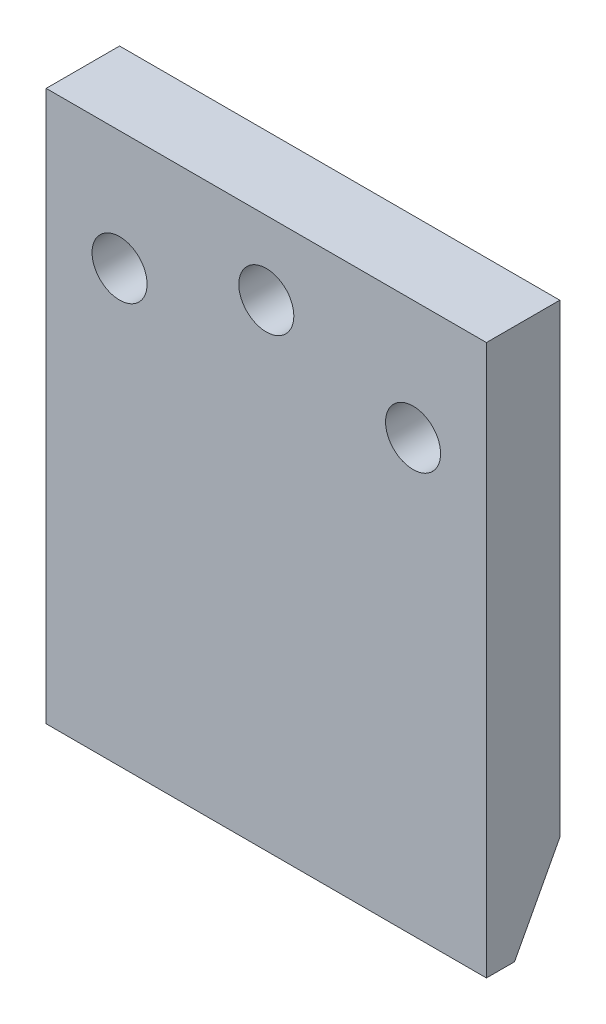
from build123d import *

# Parameters (mm, degrees)
SKETCH2_W           = 76.2
SKETCH2_H           = 95.25
SKETCH2_R           = 4.7625
BOSS_EXTRUDE1_DEPTH = 12.7
CHAMFER1_SIZE       = 14.732
CHAMFER1_SIZE2      = 7.833143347


with BuildPart() as part:
    # Sketch2 → Boss-Extrude1 (new body)
    with BuildSketch(Plane.XY):
        Rectangle(SKETCH2_W, SKETCH2_H)
        with Locations((-25.4, 27.0002)):
            Circle(SKETCH2_R, mode=Mode.SUBTRACT)
        with Locations((0, 34.925)):
            Circle(SKETCH2_R, mode=Mode.SUBTRACT)
        with Locations((25.4, 27.0002)):
            Circle(SKETCH2_R, mode=Mode.SUBTRACT)
    extrude(amount=-BOSS_EXTRUDE1_DEPTH)

    # Chamfer1
    chamfer1_edges = [part.edges().sort_by_distance(p)[0] for p in [
        (0, -47.625, -12.7),
    ]]
    chamfer1_side = [part.faces().sort_by_distance(p)[0] for p in [
        (0, -0.899516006, -12.7),
    ]]
    chamfer(chamfer1_edges, length=CHAMFER1_SIZE, length2=CHAMFER1_SIZE2, reference=chamfer1_side[0])


solid = part.part
